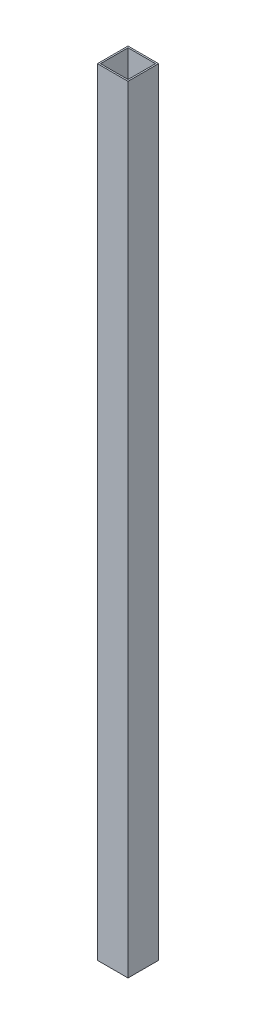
from build123d import *

# Parameters (mm, degrees)
SKETCH1_W           = 50
SKETCH1_H           = 50
BOSS_EXTRUDE1_DEPTH = 1270
SHELL1_T            = -2.5


with BuildPart() as part:
    # Sketch1 → Boss-Extrude1 (new body)
    with BuildSketch(Plane(origin=(0, 0, 0), x_dir=(1, 0, 0), z_dir=(0, 1, 0))):
        Rectangle(SKETCH1_W, SKETCH1_H)
    extrude(amount=BOSS_EXTRUDE1_DEPTH)

    # Shell1
    shell1_openings = [part.faces().sort_by_distance(p)[0] for p in [
        (0, 1270, 0),
        (0, 0, 0),
    ]]
    offset(amount=SHELL1_T, openings=shell1_openings, kind=Kind.INTERSECTION)


solid = part.part
